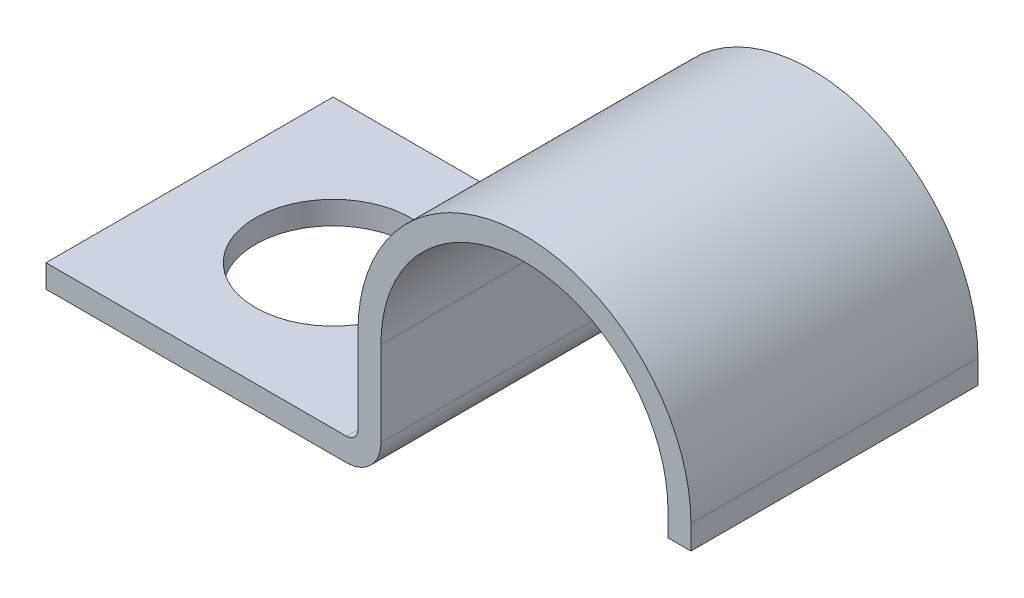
ISO-10303-21;
HEADER;
FILE_DESCRIPTION(('STEP AP214'),'2;1');
FILE_NAME('part.step','',(''),(''),'','','');
FILE_SCHEMA(('AUTOMOTIVE_DESIGN { 1 0 10303 214 1 1 1 1 }'));
ENDSEC;
DATA;
#1=APPLICATION_CONTEXT('core data for automotive mechanical design processes');
#2=APPLICATION_PROTOCOL_DEFINITION('international standard','automotive_design',2000,#1);
#3=PRODUCT_CONTEXT('',#1,'mechanical');
#4=PRODUCT('Part','Part','',(#3));
#5=PRODUCT_RELATED_PRODUCT_CATEGORY('part','',(#4));
#6=PRODUCT_DEFINITION_FORMATION('','',#4);
#7=PRODUCT_DEFINITION_CONTEXT('part definition',#1,'design');
#8=PRODUCT_DEFINITION('design','',#6,#7);
#9=PRODUCT_DEFINITION_SHAPE('','',#8);
#10=(LENGTH_UNIT() NAMED_UNIT(*) SI_UNIT(.MILLI.,.METRE.));
#11=(NAMED_UNIT(*) PLANE_ANGLE_UNIT() SI_UNIT($,.RADIAN.));
#12=(NAMED_UNIT(*) SI_UNIT($,.STERADIAN.) SOLID_ANGLE_UNIT());
#13=UNCERTAINTY_MEASURE_WITH_UNIT(LENGTH_MEASURE(1.E-05),#10,'distance_accuracy_value','');
#14=(GEOMETRIC_REPRESENTATION_CONTEXT(3) GLOBAL_UNCERTAINTY_ASSIGNED_CONTEXT((#13)) GLOBAL_UNIT_ASSIGNED_CONTEXT((#10,
#11,#12)) REPRESENTATION_CONTEXT('',''));
#15=CARTESIAN_POINT('',(0.,0.,0.));
#16=DIRECTION('',(0.,0.,1.));
#17=DIRECTION('',(1.,0.,0.));
#18=AXIS2_PLACEMENT_3D('',#15,#16,#17);
#19=CARTESIAN_POINT('',(41.275,7.9248,9.525));
#20=DIRECTION('',(1.,0.,0.));
#21=DIRECTION('',(0.,0.,-1.));
#22=AXIS2_PLACEMENT_3D('',#19,#20,#21);
#23=PLANE('',#22);
#24=DIRECTION('',(0.,-1.,0.));
#25=VECTOR('',#24,1.);
#26=CARTESIAN_POINT('',(41.275,7.9248,-9.525));
#27=LINE('',#26,#25);
#28=CARTESIAN_POINT('',(41.275,7.9248,-9.525));
#29=VERTEX_POINT('',#28);
#30=CARTESIAN_POINT('',(41.275,6.35,-9.525));
#31=VERTEX_POINT('',#30);
#32=EDGE_CURVE('E154',#29,#31,#27,.T.);
#33=ORIENTED_EDGE('',*,*,#32,.T.);
#34=DIRECTION('',(0.,0.,-1.));
#35=VECTOR('',#34,1.);
#36=CARTESIAN_POINT('',(41.275,6.35,9.525));
#37=LINE('',#36,#35);
#38=CARTESIAN_POINT('',(41.275,6.35,9.525));
#39=VERTEX_POINT('',#38);
#40=EDGE_CURVE('E11',#39,#31,#37,.T.);
#41=ORIENTED_EDGE('',*,*,#40,.F.);
#42=DIRECTION('',(0.,-1.,0.));
#43=VECTOR('',#42,1.);
#44=CARTESIAN_POINT('',(41.275,7.9248,9.525));
#45=LINE('',#44,#43);
#46=CARTESIAN_POINT('',(41.275,7.9248,9.525));
#47=VERTEX_POINT('',#46);
#48=EDGE_CURVE('E102',#47,#39,#45,.T.);
#49=ORIENTED_EDGE('',*,*,#48,.F.);
#50=DIRECTION('',(0.,0.,-1.));
#51=VECTOR('',#50,1.);
#52=CARTESIAN_POINT('',(41.275,7.9248,9.525));
#53=LINE('',#52,#51);
#54=EDGE_CURVE('E150',#47,#29,#53,.T.);
#55=ORIENTED_EDGE('',*,*,#54,.T.);
#56=EDGE_LOOP('',(#33,#41,#49,#55));
#57=FACE_BOUND('',#56,.T.);
#58=ADVANCED_FACE('F34',(#57),#23,.F.);
#59=CARTESIAN_POINT('',(42.799,6.35,9.525));
#60=DIRECTION('',(0.,-1.,0.));
#61=DIRECTION('',(0.,0.,-1.));
#62=AXIS2_PLACEMENT_3D('',#59,#60,#61);
#63=PLANE('',#62);
#64=DIRECTION('',(-1.,0.,0.));
#65=VECTOR('',#64,1.);
#66=CARTESIAN_POINT('',(42.799,6.35,-9.525));
#67=LINE('',#66,#65);
#68=CARTESIAN_POINT('',(42.799,6.35,-9.525));
#69=VERTEX_POINT('',#68);
#70=EDGE_CURVE('E157',#69,#31,#67,.T.);
#71=ORIENTED_EDGE('',*,*,#70,.F.);
#72=DIRECTION('',(0.,0.,-1.));
#73=VECTOR('',#72,1.);
#74=CARTESIAN_POINT('',(42.799,6.35,9.525));
#75=LINE('',#74,#73);
#76=CARTESIAN_POINT('',(42.799,6.35,9.525));
#77=VERTEX_POINT('',#76);
#78=EDGE_CURVE('E42',#77,#69,#75,.T.);
#79=ORIENTED_EDGE('',*,*,#78,.F.);
#80=DIRECTION('',(-1.,0.,0.));
#81=VECTOR('',#80,1.);
#82=CARTESIAN_POINT('',(42.799,6.35,9.525));
#83=LINE('',#82,#81);
#84=EDGE_CURVE('E220',#77,#39,#83,.T.);
#85=ORIENTED_EDGE('',*,*,#84,.T.);
#86=ORIENTED_EDGE('',*,*,#40,.T.);
#87=EDGE_LOOP('',(#71,#79,#85,#86));
#88=FACE_BOUND('',#87,.T.);
#89=ADVANCED_FACE('F207',(#88),#63,.T.);
#90=CARTESIAN_POINT('',(42.799,7.9248,9.525));
#91=DIRECTION('',(1.,0.,0.));
#92=DIRECTION('',(0.,0.,-1.));
#93=AXIS2_PLACEMENT_3D('',#90,#91,#92);
#94=PLANE('',#93);
#95=DIRECTION('',(0.,1.,0.));
#96=VECTOR('',#95,1.);
#97=CARTESIAN_POINT('',(42.799,7.9248,-9.525));
#98=LINE('',#97,#96);
#99=CARTESIAN_POINT('',(42.799,7.9248,-9.525));
#100=VERTEX_POINT('',#99);
#101=EDGE_CURVE('E161',#100,#69,#98,.F.);
#102=ORIENTED_EDGE('',*,*,#101,.F.);
#103=DIRECTION('',(0.,0.,-1.));
#104=VECTOR('',#103,1.);
#105=CARTESIAN_POINT('',(42.799,7.9248,9.525));
#106=LINE('',#105,#104);
#107=CARTESIAN_POINT('',(42.799,7.9248,9.525));
#108=VERTEX_POINT('',#107);
#109=EDGE_CURVE('E197',#108,#100,#106,.T.);
#110=ORIENTED_EDGE('',*,*,#109,.F.);
#111=DIRECTION('',(0.,1.,0.));
#112=VECTOR('',#111,1.);
#113=CARTESIAN_POINT('',(42.799,7.9248,9.525));
#114=LINE('',#113,#112);
#115=EDGE_CURVE('E204',#108,#77,#114,.F.);
#116=ORIENTED_EDGE('',*,*,#115,.T.);
#117=ORIENTED_EDGE('',*,*,#78,.T.);
#118=EDGE_LOOP('',(#102,#110,#116,#117));
#119=FACE_BOUND('',#118,.T.);
#120=ADVANCED_FACE('F202',(#119),#94,.T.);
#121=CARTESIAN_POINT('',(31.75,7.9248,9.525));
#122=DIRECTION('',(0.,0.,-1.));
#123=DIRECTION('',(-1.,0.,0.));
#124=AXIS2_PLACEMENT_3D('',#121,#122,#123);
#125=CYLINDRICAL_SURFACE('',#124,11.049);
#126=CARTESIAN_POINT('',(31.75,7.9248,-9.525));
#127=DIRECTION('',(0.,0.,1.));
#128=DIRECTION('',(1.,0.,0.));
#129=AXIS2_PLACEMENT_3D('',#126,#127,#128);
#130=CIRCLE('',#129,11.049);
#131=CARTESIAN_POINT('',(20.701,7.9248,-9.525));
#132=VERTEX_POINT('',#131);
#133=EDGE_CURVE('E164',#132,#100,#130,.F.);
#134=ORIENTED_EDGE('',*,*,#133,.F.);
#135=DIRECTION('',(0.,0.,-1.));
#136=VECTOR('',#135,1.);
#137=CARTESIAN_POINT('',(20.701,7.9248,9.525));
#138=LINE('',#137,#136);
#139=CARTESIAN_POINT('',(20.701,7.9248,9.525));
#140=VERTEX_POINT('',#139);
#141=EDGE_CURVE('E195',#140,#132,#138,.T.);
#142=ORIENTED_EDGE('',*,*,#141,.F.);
#143=CARTESIAN_POINT('',(31.75,7.9248,9.525));
#144=DIRECTION('',(0.,0.,1.));
#145=DIRECTION('',(1.,0.,0.));
#146=AXIS2_PLACEMENT_3D('',#143,#144,#145);
#147=CIRCLE('',#146,11.049);
#148=EDGE_CURVE('E217',#140,#108,#147,.F.);
#149=ORIENTED_EDGE('',*,*,#148,.T.);
#150=ORIENTED_EDGE('',*,*,#109,.T.);
#151=EDGE_LOOP('',(#134,#142,#149,#150));
#152=FACE_BOUND('',#151,.T.);
#153=ADVANCED_FACE('F214',(#152),#125,.T.);
#154=CARTESIAN_POINT('',(20.701,2.286,9.525));
#155=DIRECTION('',(-1.,0.,0.));
#156=DIRECTION('',(0.,0.,1.));
#157=AXIS2_PLACEMENT_3D('',#154,#155,#156);
#158=PLANE('',#157);
#159=DIRECTION('',(0.,1.,0.));
#160=VECTOR('',#159,1.);
#161=CARTESIAN_POINT('',(20.701,2.286,-9.525));
#162=LINE('',#161,#160);
#163=CARTESIAN_POINT('',(20.701,2.286,-9.525));
#164=VERTEX_POINT('',#163);
#165=EDGE_CURVE('E167',#164,#132,#162,.T.);
#166=ORIENTED_EDGE('',*,*,#165,.F.);
#167=DIRECTION('',(0.,0.,-1.));
#168=VECTOR('',#167,1.);
#169=CARTESIAN_POINT('',(20.701,2.286,9.525));
#170=LINE('',#169,#168);
#171=CARTESIAN_POINT('',(20.701,2.286,9.525));
#172=VERTEX_POINT('',#171);
#173=EDGE_CURVE('E193',#172,#164,#170,.T.);
#174=ORIENTED_EDGE('',*,*,#173,.F.);
#175=DIRECTION('',(0.,1.,0.));
#176=VECTOR('',#175,1.);
#177=CARTESIAN_POINT('',(20.701,2.286,9.525));
#178=LINE('',#177,#176);
#179=EDGE_CURVE('E222',#172,#140,#178,.T.);
#180=ORIENTED_EDGE('',*,*,#179,.T.);
#181=ORIENTED_EDGE('',*,*,#141,.T.);
#182=EDGE_LOOP('',(#166,#174,#180,#181));
#183=FACE_BOUND('',#182,.T.);
#184=ADVANCED_FACE('F294',(#183),#158,.T.);
#185=CARTESIAN_POINT('',(19.939,2.286,9.525));
#186=DIRECTION('',(0.,0.,-1.));
#187=DIRECTION('',(-1.,0.,0.));
#188=AXIS2_PLACEMENT_3D('',#185,#186,#187);
#189=CYLINDRICAL_SURFACE('',#188,0.762);
#190=CARTESIAN_POINT('',(19.939,2.286,-9.525));
#191=DIRECTION('',(0.,0.,1.));
#192=DIRECTION('',(1.,0.,0.));
#193=AXIS2_PLACEMENT_3D('',#190,#191,#192);
#194=CIRCLE('',#193,0.762);
#195=CARTESIAN_POINT('',(19.939,1.524,-9.525));
#196=VERTEX_POINT('',#195);
#197=EDGE_CURVE('E170',#196,#164,#194,.T.);
#198=ORIENTED_EDGE('',*,*,#197,.F.);
#199=DIRECTION('',(0.,0.,-1.));
#200=VECTOR('',#199,1.);
#201=CARTESIAN_POINT('',(19.939,1.524,9.525));
#202=LINE('',#201,#200);
#203=CARTESIAN_POINT('',(19.939,1.524,9.525));
#204=VERTEX_POINT('',#203);
#205=EDGE_CURVE('E191',#204,#196,#202,.T.);
#206=ORIENTED_EDGE('',*,*,#205,.F.);
#207=CARTESIAN_POINT('',(19.939,2.286,9.525));
#208=DIRECTION('',(0.,0.,1.));
#209=DIRECTION('',(1.,0.,0.));
#210=AXIS2_PLACEMENT_3D('',#207,#208,#209);
#211=CIRCLE('',#210,0.762);
#212=EDGE_CURVE('E228',#204,#172,#211,.T.);
#213=ORIENTED_EDGE('',*,*,#212,.T.);
#214=ORIENTED_EDGE('',*,*,#173,.T.);
#215=EDGE_LOOP('',(#198,#206,#213,#214));
#216=FACE_BOUND('',#215,.T.);
#217=ADVANCED_FACE('F289',(#216),#189,.F.);
#218=CARTESIAN_POINT('',(0.,1.524,9.525));
#219=DIRECTION('',(0.,1.,0.));
#220=DIRECTION('',(0.,0.,1.));
#221=AXIS2_PLACEMENT_3D('',#218,#219,#220);
#222=PLANE('',#221);
#223=CARTESIAN_POINT('',(9.525,1.524,0.));
#224=DIRECTION('',(0.,1.,0.));
#225=DIRECTION('',(0.,0.,1.));
#226=AXIS2_PLACEMENT_3D('',#223,#224,#225);
#227=CIRCLE('',#226,5.1562);
#228=CARTESIAN_POINT('',(9.525,1.524,5.1562));
#229=VERTEX_POINT('',#228);
#230=EDGE_CURVE('E284',#229,#229,#227,.T.);
#231=ORIENTED_EDGE('',*,*,#230,.F.);
#232=EDGE_LOOP('',(#231));
#233=FACE_BOUND('',#232,.T.);
#234=DIRECTION('',(1.,0.,0.));
#235=VECTOR('',#234,1.);
#236=CARTESIAN_POINT('',(0.,1.524,-9.525));
#237=LINE('',#236,#235);
#238=CARTESIAN_POINT('',(0.,1.524,-9.525));
#239=VERTEX_POINT('',#238);
#240=EDGE_CURVE('E173',#239,#196,#237,.T.);
#241=ORIENTED_EDGE('',*,*,#240,.F.);
#242=DIRECTION('',(0.,0.,-1.));
#243=VECTOR('',#242,1.);
#244=CARTESIAN_POINT('',(0.,1.524,9.525));
#245=LINE('',#244,#243);
#246=CARTESIAN_POINT('',(0.,1.524,9.525));
#247=VERTEX_POINT('',#246);
#248=EDGE_CURVE('E189',#247,#239,#245,.T.);
#249=ORIENTED_EDGE('',*,*,#248,.F.);
#250=DIRECTION('',(1.,0.,0.));
#251=VECTOR('',#250,1.);
#252=CARTESIAN_POINT('',(0.,1.524,9.525));
#253=LINE('',#252,#251);
#254=EDGE_CURVE('E231',#247,#204,#253,.T.);
#255=ORIENTED_EDGE('',*,*,#254,.T.);
#256=ORIENTED_EDGE('',*,*,#205,.T.);
#257=EDGE_LOOP('',(#241,#249,#255,#256));
#258=FACE_BOUND('',#257,.T.);
#259=ADVANCED_FACE('F243',(#233,#258),#222,.T.);
#260=CARTESIAN_POINT('',(0.,0.,9.525));
#261=DIRECTION('',(-1.,0.,0.));
#262=DIRECTION('',(0.,0.,1.));
#263=AXIS2_PLACEMENT_3D('',#260,#261,#262);
#264=PLANE('',#263);
#265=DIRECTION('',(0.,1.,0.));
#266=VECTOR('',#265,1.);
#267=CARTESIAN_POINT('',(0.,0.,-9.525));
#268=LINE('',#267,#266);
#269=CARTESIAN_POINT('',(0.,0.,-9.525));
#270=VERTEX_POINT('',#269);
#271=EDGE_CURVE('E176',#270,#239,#268,.T.);
#272=ORIENTED_EDGE('',*,*,#271,.F.);
#273=DIRECTION('',(0.,0.,-1.));
#274=VECTOR('',#273,1.);
#275=CARTESIAN_POINT('',(0.,0.,9.525));
#276=LINE('',#275,#274);
#277=CARTESIAN_POINT('',(0.,0.,9.525));
#278=VERTEX_POINT('',#277);
#279=EDGE_CURVE('E187',#278,#270,#276,.T.);
#280=ORIENTED_EDGE('',*,*,#279,.F.);
#281=DIRECTION('',(0.,1.,0.));
#282=VECTOR('',#281,1.);
#283=CARTESIAN_POINT('',(0.,0.,9.525));
#284=LINE('',#283,#282);
#285=EDGE_CURVE('E234',#278,#247,#284,.T.);
#286=ORIENTED_EDGE('',*,*,#285,.T.);
#287=ORIENTED_EDGE('',*,*,#248,.T.);
#288=EDGE_LOOP('',(#272,#280,#286,#287));
#289=FACE_BOUND('',#288,.T.);
#290=ADVANCED_FACE('F238',(#289),#264,.T.);
#291=CARTESIAN_POINT('',(0.,0.,9.525));
#292=DIRECTION('',(0.,1.,0.));
#293=DIRECTION('',(0.,0.,1.));
#294=AXIS2_PLACEMENT_3D('',#291,#292,#293);
#295=PLANE('',#294);
#296=CARTESIAN_POINT('',(9.525,0.,0.));
#297=DIRECTION('',(0.,1.,0.));
#298=DIRECTION('',(0.,0.,1.));
#299=AXIS2_PLACEMENT_3D('',#296,#297,#298);
#300=CIRCLE('',#299,5.1562);
#301=CARTESIAN_POINT('',(9.525,0.,5.1562));
#302=VERTEX_POINT('',#301);
#303=EDGE_CURVE('E158',#302,#302,#300,.F.);
#304=ORIENTED_EDGE('',*,*,#303,.F.);
#305=EDGE_LOOP('',(#304));
#306=FACE_BOUND('',#305,.T.);
#307=DIRECTION('',(1.,0.,0.));
#308=VECTOR('',#307,1.);
#309=CARTESIAN_POINT('',(0.,0.,-9.525));
#310=LINE('',#309,#308);
#311=CARTESIAN_POINT('',(19.939,0.,-9.525));
#312=VERTEX_POINT('',#311);
#313=EDGE_CURVE('E179',#270,#312,#310,.T.);
#314=ORIENTED_EDGE('',*,*,#313,.T.);
#315=DIRECTION('',(0.,0.,-1.));
#316=VECTOR('',#315,1.);
#317=CARTESIAN_POINT('',(19.939,0.,9.525));
#318=LINE('',#317,#316);
#319=CARTESIAN_POINT('',(19.939,0.,9.525));
#320=VERTEX_POINT('',#319);
#321=EDGE_CURVE('E145',#320,#312,#318,.T.);
#322=ORIENTED_EDGE('',*,*,#321,.F.);
#323=DIRECTION('',(1.,0.,0.));
#324=VECTOR('',#323,1.);
#325=CARTESIAN_POINT('',(0.,0.,9.525));
#326=LINE('',#325,#324);
#327=EDGE_CURVE('E136',#278,#320,#326,.T.);
#328=ORIENTED_EDGE('',*,*,#327,.F.);
#329=ORIENTED_EDGE('',*,*,#279,.T.);
#330=EDGE_LOOP('',(#314,#322,#328,#329));
#331=FACE_BOUND('',#330,.T.);
#332=ADVANCED_FACE('F247',(#306,#331),#295,.F.);
#333=CARTESIAN_POINT('',(19.939,2.286,9.525));
#334=DIRECTION('',(0.,0.,-1.));
#335=DIRECTION('',(-1.,0.,0.));
#336=AXIS2_PLACEMENT_3D('',#333,#334,#335);
#337=CYLINDRICAL_SURFACE('',#336,2.286);
#338=CARTESIAN_POINT('',(19.939,2.286,-9.525));
#339=DIRECTION('',(0.,0.,1.));
#340=DIRECTION('',(1.,0.,0.));
#341=AXIS2_PLACEMENT_3D('',#338,#339,#340);
#342=CIRCLE('',#341,2.286);
#343=CARTESIAN_POINT('',(22.225,2.286,-9.525));
#344=VERTEX_POINT('',#343);
#345=EDGE_CURVE('E144',#312,#344,#342,.T.);
#346=ORIENTED_EDGE('',*,*,#345,.T.);
#347=DIRECTION('',(0.,0.,-1.));
#348=VECTOR('',#347,1.);
#349=CARTESIAN_POINT('',(22.225,2.286,9.525));
#350=LINE('',#349,#348);
#351=CARTESIAN_POINT('',(22.225,2.286,9.525));
#352=VERTEX_POINT('',#351);
#353=EDGE_CURVE('E141',#352,#344,#350,.T.);
#354=ORIENTED_EDGE('',*,*,#353,.F.);
#355=CARTESIAN_POINT('',(19.939,2.286,9.525));
#356=DIRECTION('',(0.,0.,1.));
#357=DIRECTION('',(1.,0.,0.));
#358=AXIS2_PLACEMENT_3D('',#355,#356,#357);
#359=CIRCLE('',#358,2.286);
#360=EDGE_CURVE('E129',#320,#352,#359,.T.);
#361=ORIENTED_EDGE('',*,*,#360,.F.);
#362=ORIENTED_EDGE('',*,*,#321,.T.);
#363=EDGE_LOOP('',(#346,#354,#361,#362));
#364=FACE_BOUND('',#363,.T.);
#365=ADVANCED_FACE('F142',(#364),#337,.T.);
#366=CARTESIAN_POINT('',(22.225,2.286,9.525));
#367=DIRECTION('',(-1.,0.,0.));
#368=DIRECTION('',(0.,0.,1.));
#369=AXIS2_PLACEMENT_3D('',#366,#367,#368);
#370=PLANE('',#369);
#371=DIRECTION('',(0.,1.,0.));
#372=VECTOR('',#371,1.);
#373=CARTESIAN_POINT('',(22.225,2.286,-9.525));
#374=LINE('',#373,#372);
#375=CARTESIAN_POINT('',(22.225,7.9248,-9.525));
#376=VERTEX_POINT('',#375);
#377=EDGE_CURVE('E90',#344,#376,#374,.T.);
#378=ORIENTED_EDGE('',*,*,#377,.T.);
#379=DIRECTION('',(0.,0.,-1.));
#380=VECTOR('',#379,1.);
#381=CARTESIAN_POINT('',(22.225,7.9248,9.525));
#382=LINE('',#381,#380);
#383=CARTESIAN_POINT('',(22.225,7.9248,9.525));
#384=VERTEX_POINT('',#383);
#385=EDGE_CURVE('E146',#384,#376,#382,.T.);
#386=ORIENTED_EDGE('',*,*,#385,.F.);
#387=DIRECTION('',(0.,1.,0.));
#388=VECTOR('',#387,1.);
#389=CARTESIAN_POINT('',(22.225,2.286,9.525));
#390=LINE('',#389,#388);
#391=EDGE_CURVE('E133',#352,#384,#390,.T.);
#392=ORIENTED_EDGE('',*,*,#391,.F.);
#393=ORIENTED_EDGE('',*,*,#353,.T.);
#394=EDGE_LOOP('',(#378,#386,#392,#393));
#395=FACE_BOUND('',#394,.T.);
#396=ADVANCED_FACE('F148',(#395),#370,.F.);
#397=CARTESIAN_POINT('',(31.75,7.9248,9.525));
#398=DIRECTION('',(0.,0.,-1.));
#399=DIRECTION('',(-1.,0.,0.));
#400=AXIS2_PLACEMENT_3D('',#397,#398,#399);
#401=CYLINDRICAL_SURFACE('',#400,9.525);
#402=CARTESIAN_POINT('',(31.75,7.9248,-9.525));
#403=DIRECTION('',(0.,0.,-1.));
#404=DIRECTION('',(-1.,0.,0.));
#405=AXIS2_PLACEMENT_3D('',#402,#403,#404);
#406=CIRCLE('',#405,9.525);
#407=EDGE_CURVE('E96',#376,#29,#406,.T.);
#408=ORIENTED_EDGE('',*,*,#407,.T.);
#409=ORIENTED_EDGE('',*,*,#54,.F.);
#410=CARTESIAN_POINT('',(31.75,7.9248,9.525));
#411=DIRECTION('',(0.,0.,-1.));
#412=DIRECTION('',(-1.,0.,0.));
#413=AXIS2_PLACEMENT_3D('',#410,#411,#412);
#414=CIRCLE('',#413,9.525);
#415=EDGE_CURVE('E50',#384,#47,#414,.T.);
#416=ORIENTED_EDGE('',*,*,#415,.F.);
#417=ORIENTED_EDGE('',*,*,#385,.T.);
#418=EDGE_LOOP('',(#408,#409,#416,#417));
#419=FACE_BOUND('',#418,.T.);
#420=ADVANCED_FACE('F263',(#419),#401,.F.);
#421=CARTESIAN_POINT('',(31.75,7.9248,9.525));
#422=DIRECTION('',(0.,0.,1.));
#423=DIRECTION('',(1.,0.,0.));
#424=AXIS2_PLACEMENT_3D('',#421,#422,#423);
#425=PLANE('',#424);
#426=ORIENTED_EDGE('',*,*,#48,.T.);
#427=ORIENTED_EDGE('',*,*,#84,.F.);
#428=ORIENTED_EDGE('',*,*,#115,.F.);
#429=ORIENTED_EDGE('',*,*,#148,.F.);
#430=ORIENTED_EDGE('',*,*,#179,.F.);
#431=ORIENTED_EDGE('',*,*,#212,.F.);
#432=ORIENTED_EDGE('',*,*,#254,.F.);
#433=ORIENTED_EDGE('',*,*,#285,.F.);
#434=ORIENTED_EDGE('',*,*,#327,.T.);
#435=ORIENTED_EDGE('',*,*,#360,.T.);
#436=ORIENTED_EDGE('',*,*,#391,.T.);
#437=ORIENTED_EDGE('',*,*,#415,.T.);
#438=EDGE_LOOP('',(#426,#427,#428,#429,#430,#431,#432,#433,#434,#435,#436,#437));
#439=FACE_BOUND('',#438,.T.);
#440=ADVANCED_FACE('F131',(#439),#425,.T.);
#441=CARTESIAN_POINT('',(31.75,7.9248,-9.525));
#442=DIRECTION('',(0.,0.,1.));
#443=DIRECTION('',(1.,0.,0.));
#444=AXIS2_PLACEMENT_3D('',#441,#442,#443);
#445=PLANE('',#444);
#446=ORIENTED_EDGE('',*,*,#32,.F.);
#447=ORIENTED_EDGE('',*,*,#407,.F.);
#448=ORIENTED_EDGE('',*,*,#377,.F.);
#449=ORIENTED_EDGE('',*,*,#345,.F.);
#450=ORIENTED_EDGE('',*,*,#313,.F.);
#451=ORIENTED_EDGE('',*,*,#271,.T.);
#452=ORIENTED_EDGE('',*,*,#240,.T.);
#453=ORIENTED_EDGE('',*,*,#197,.T.);
#454=ORIENTED_EDGE('',*,*,#165,.T.);
#455=ORIENTED_EDGE('',*,*,#133,.T.);
#456=ORIENTED_EDGE('',*,*,#101,.T.);
#457=ORIENTED_EDGE('',*,*,#70,.T.);
#458=EDGE_LOOP('',(#446,#447,#448,#449,#450,#451,#452,#453,#454,#455,#456,#457));
#459=FACE_BOUND('',#458,.T.);
#460=ADVANCED_FACE('F210',(#459),#445,.F.);
#461=CARTESIAN_POINT('',(9.525,-14.5839359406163,0.));
#462=DIRECTION('',(0.,1.,0.));
#463=DIRECTION('',(0.,0.,1.));
#464=AXIS2_PLACEMENT_3D('',#461,#462,#463);
#465=CYLINDRICAL_SURFACE('',#464,5.1562);
#466=CARTESIAN_POINT('',(9.525,0.,5.1562));
#467=CARTESIAN_POINT('',(9.525,0.0158750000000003,5.1562));
#468=CARTESIAN_POINT('',(9.525,0.0317500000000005,5.1562));
#469=CARTESIAN_POINT('',(9.525,0.0635000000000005,5.1562));
#470=CARTESIAN_POINT('',(9.525,0.0793750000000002,5.1562));
#471=CARTESIAN_POINT('',(9.525,0.111125,5.1562));
#472=CARTESIAN_POINT('',(9.525,0.127,5.1562));
#473=CARTESIAN_POINT('',(9.525,0.15875,5.1562));
#474=CARTESIAN_POINT('',(9.525,0.174625,5.1562));
#475=CARTESIAN_POINT('',(9.525,0.206375,5.1562));
#476=CARTESIAN_POINT('',(9.525,0.22225,5.1562));
#477=CARTESIAN_POINT('',(9.525,0.254000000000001,5.1562));
#478=CARTESIAN_POINT('',(9.525,0.269875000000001,5.1562));
#479=CARTESIAN_POINT('',(9.525,0.301625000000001,5.1562));
#480=CARTESIAN_POINT('',(9.525,0.317500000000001,5.1562));
#481=CARTESIAN_POINT('',(9.525,0.349250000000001,5.1562));
#482=CARTESIAN_POINT('',(9.525,0.365125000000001,5.1562));
#483=CARTESIAN_POINT('',(9.525,0.396875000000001,5.1562));
#484=CARTESIAN_POINT('',(9.525,0.412750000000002,5.1562));
#485=CARTESIAN_POINT('',(9.525,0.444500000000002,5.1562));
#486=CARTESIAN_POINT('',(9.525,0.460375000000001,5.1562));
#487=CARTESIAN_POINT('',(9.525,0.492125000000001,5.1562));
#488=CARTESIAN_POINT('',(9.525,0.508000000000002,5.1562));
#489=CARTESIAN_POINT('',(9.525,0.539750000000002,5.1562));
#490=CARTESIAN_POINT('',(9.525,0.555625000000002,5.1562));
#491=CARTESIAN_POINT('',(9.525,0.587375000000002,5.1562));
#492=CARTESIAN_POINT('',(9.525,0.603250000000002,5.1562));
#493=CARTESIAN_POINT('',(9.525,0.635000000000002,5.1562));
#494=CARTESIAN_POINT('',(9.525,0.650875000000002,5.1562));
#495=CARTESIAN_POINT('',(9.525,0.682625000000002,5.1562));
#496=CARTESIAN_POINT('',(9.525,0.698500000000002,5.1562));
#497=CARTESIAN_POINT('',(9.525,0.730250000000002,5.1562));
#498=CARTESIAN_POINT('',(9.525,0.746125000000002,5.1562));
#499=CARTESIAN_POINT('',(9.525,0.777875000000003,5.1562));
#500=CARTESIAN_POINT('',(9.525,0.793750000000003,5.1562));
#501=CARTESIAN_POINT('',(9.525,0.825500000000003,5.1562));
#502=CARTESIAN_POINT('',(9.525,0.841375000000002,5.1562));
#503=CARTESIAN_POINT('',(9.525,0.873125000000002,5.1562));
#504=CARTESIAN_POINT('',(9.525,0.889000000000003,5.1562));
#505=CARTESIAN_POINT('',(9.525,0.920750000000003,5.1562));
#506=CARTESIAN_POINT('',(9.525,0.936625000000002,5.1562));
#507=CARTESIAN_POINT('',(9.525,0.968375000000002,5.1562));
#508=CARTESIAN_POINT('',(9.525,0.984250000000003,5.1562));
#509=CARTESIAN_POINT('',(9.525,1.016,5.1562));
#510=CARTESIAN_POINT('',(9.525,1.031875,5.1562));
#511=CARTESIAN_POINT('',(9.525,1.063625,5.1562));
#512=CARTESIAN_POINT('',(9.525,1.0795,5.1562));
#513=CARTESIAN_POINT('',(9.525,1.11125,5.1562));
#514=CARTESIAN_POINT('',(9.525,1.127125,5.1562));
#515=CARTESIAN_POINT('',(9.525,1.158875,5.1562));
#516=CARTESIAN_POINT('',(9.525,1.17475,5.1562));
#517=CARTESIAN_POINT('',(9.525,1.2065,5.1562));
#518=CARTESIAN_POINT('',(9.525,1.222375,5.1562));
#519=CARTESIAN_POINT('',(9.525,1.254125,5.1562));
#520=CARTESIAN_POINT('',(9.525,1.27,5.1562));
#521=CARTESIAN_POINT('',(9.525,1.30175,5.1562));
#522=CARTESIAN_POINT('',(9.525,1.317625,5.1562));
#523=CARTESIAN_POINT('',(9.525,1.349375,5.1562));
#524=CARTESIAN_POINT('',(9.525,1.36525,5.1562));
#525=CARTESIAN_POINT('',(9.525,1.397,5.1562));
#526=CARTESIAN_POINT('',(9.525,1.412875,5.1562));
#527=CARTESIAN_POINT('',(9.525,1.444625,5.1562));
#528=CARTESIAN_POINT('',(9.525,1.4605,5.1562));
#529=CARTESIAN_POINT('',(9.525,1.49225,5.1562));
#530=CARTESIAN_POINT('',(9.525,1.508125,5.1562));
#531=CARTESIAN_POINT('',(9.525,1.524,5.1562));
#532=B_SPLINE_CURVE_WITH_KNOTS('',3,(#466,#467,#468,#469,#470,#471,#472,#473,#474,#475,#476,
#477,#478,#479,#480,#481,#482,#483,#484,#485,#486,#487,#488,#489,#490,#491,#492,#493,#494,#495,
#496,#497,#498,#499,#500,#501,#502,#503,#504,#505,#506,#507,#508,#509,#510,#511,#512,#513,#514,
#515,#516,#517,#518,#519,#520,#521,#522,#523,#524,#525,#526,#527,#528,#529,#530,#531),
.UNSPECIFIED.,.F.,.F.,(4,2,2,2,2,2,2,2,2,2,2,2,2,2,2,2,2,2,2,2,2,2,2,2,2,2,2,2,2,2,2,2,4),(0.,
0.0476250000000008,0.0952499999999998,0.142875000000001,0.1905,0.238125,0.285750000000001,
0.333375,0.381000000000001,0.428625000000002,0.476250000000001,0.523875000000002,
0.571500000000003,0.619125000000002,0.666750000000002,0.714375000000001,0.762000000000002,
0.809625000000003,0.857250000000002,0.904875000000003,0.952500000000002,1.000125,1.04775,
1.095375,1.143,1.190625,1.23825,1.285875,1.3335,1.381125,1.42875,1.476375,1.524),.UNSPECIFIED.);
#533=EDGE_CURVE('BSEAM274',#302,#229,#532,.T.);
#534=ORIENTED_EDGE('',*,*,#303,.T.);
#535=ORIENTED_EDGE('',*,*,#230,.T.);
#536=ORIENTED_EDGE('',*,*,#533,.T.);
#537=ORIENTED_EDGE('',*,*,#533,.F.);
#538=EDGE_LOOP('',(#534,#536,#535,#537));
#539=FACE_BOUND('',#538,.T.);
#540=ADVANCED_FACE('F274',(#539),#465,.F.);
#541=CLOSED_SHELL('',(#58,#89,#120,#153,#184,#217,#259,#290,#332,#365,#396,#420,#440,#460,#540));
#542=MANIFOLD_SOLID_BREP('B2',#541);
#543=ADVANCED_BREP_SHAPE_REPRESENTATION('',(#18,#542),#14);
#544=SHAPE_DEFINITION_REPRESENTATION(#9,#543);
ENDSEC;
END-ISO-10303-21;
